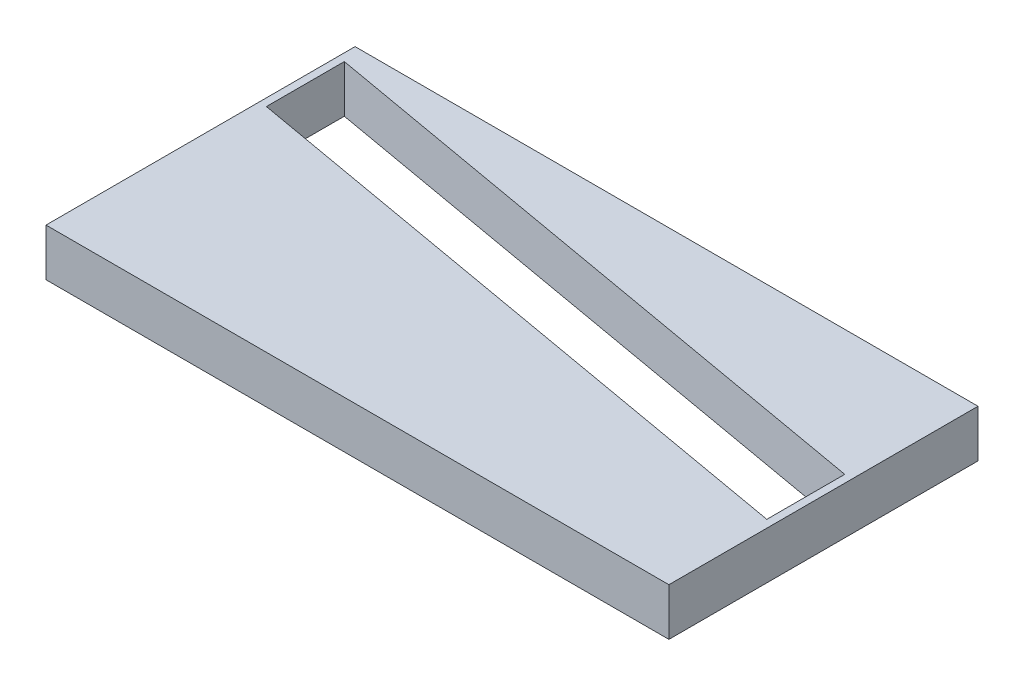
ISO-10303-21;
HEADER;
FILE_DESCRIPTION(('STEP AP214'),'2;1');
FILE_NAME('part.step','',(''),(''),'','','');
FILE_SCHEMA(('AUTOMOTIVE_DESIGN { 1 0 10303 214 1 1 1 1 }'));
ENDSEC;
DATA;
#1=APPLICATION_CONTEXT('core data for automotive mechanical design processes');
#2=APPLICATION_PROTOCOL_DEFINITION('international standard','automotive_design',2000,#1);
#3=PRODUCT_CONTEXT('',#1,'mechanical');
#4=PRODUCT('Part','Part','',(#3));
#5=PRODUCT_RELATED_PRODUCT_CATEGORY('part','',(#4));
#6=PRODUCT_DEFINITION_FORMATION('','',#4);
#7=PRODUCT_DEFINITION_CONTEXT('part definition',#1,'design');
#8=PRODUCT_DEFINITION('design','',#6,#7);
#9=PRODUCT_DEFINITION_SHAPE('','',#8);
#10=(LENGTH_UNIT() NAMED_UNIT(*) SI_UNIT(.MILLI.,.METRE.));
#11=(NAMED_UNIT(*) PLANE_ANGLE_UNIT() SI_UNIT($,.RADIAN.));
#12=(NAMED_UNIT(*) SI_UNIT($,.STERADIAN.) SOLID_ANGLE_UNIT());
#13=UNCERTAINTY_MEASURE_WITH_UNIT(LENGTH_MEASURE(1.E-05),#10,'distance_accuracy_value','');
#14=(GEOMETRIC_REPRESENTATION_CONTEXT(3) GLOBAL_UNCERTAINTY_ASSIGNED_CONTEXT((#13)) GLOBAL_UNIT_ASSIGNED_CONTEXT((#10,
#11,#12)) REPRESENTATION_CONTEXT('',''));
#15=CARTESIAN_POINT('',(0.,0.,0.));
#16=DIRECTION('',(0.,0.,1.));
#17=DIRECTION('',(1.,0.,0.));
#18=AXIS2_PLACEMENT_3D('',#15,#16,#17);
#19=CARTESIAN_POINT('',(668.02,50.8,-331.47));
#20=DIRECTION('',(-1.,0.,0.));
#21=DIRECTION('',(0.,0.,1.));
#22=AXIS2_PLACEMENT_3D('',#19,#20,#21);
#23=PLANE('',#22);
#24=DIRECTION('',(0.,0.,-1.));
#25=VECTOR('',#24,1.);
#26=CARTESIAN_POINT('',(668.02,-50.8,-331.47));
#27=LINE('',#26,#25);
#28=CARTESIAN_POINT('',(668.02,-50.8,331.47));
#29=VERTEX_POINT('',#28);
#30=CARTESIAN_POINT('',(668.02,-50.8,-331.47));
#31=VERTEX_POINT('',#30);
#32=EDGE_CURVE('E129',#29,#31,#27,.T.);
#33=ORIENTED_EDGE('',*,*,#32,.T.);
#34=DIRECTION('',(0.,-1.,0.));
#35=VECTOR('',#34,1.);
#36=CARTESIAN_POINT('',(668.02,50.8,-331.47));
#37=LINE('',#36,#35);
#38=CARTESIAN_POINT('',(668.02,50.8,-331.47));
#39=VERTEX_POINT('',#38);
#40=EDGE_CURVE('E11',#39,#31,#37,.T.);
#41=ORIENTED_EDGE('',*,*,#40,.F.);
#42=DIRECTION('',(0.,0.,-1.));
#43=VECTOR('',#42,1.);
#44=CARTESIAN_POINT('',(668.02,50.8,-331.47));
#45=LINE('',#44,#43);
#46=CARTESIAN_POINT('',(668.02,50.8,331.47));
#47=VERTEX_POINT('',#46);
#48=EDGE_CURVE('E133',#47,#39,#45,.T.);
#49=ORIENTED_EDGE('',*,*,#48,.F.);
#50=DIRECTION('',(0.,-1.,0.));
#51=VECTOR('',#50,1.);
#52=CARTESIAN_POINT('',(668.02,50.8,331.47));
#53=LINE('',#52,#51);
#54=EDGE_CURVE('E143',#47,#29,#53,.T.);
#55=ORIENTED_EDGE('',*,*,#54,.T.);
#56=EDGE_LOOP('',(#33,#41,#49,#55));
#57=FACE_BOUND('',#56,.T.);
#58=ADVANCED_FACE('F32',(#57),#23,.F.);
#59=CARTESIAN_POINT('',(-668.02,50.8,-331.47));
#60=DIRECTION('',(0.,0.,1.));
#61=DIRECTION('',(1.,0.,0.));
#62=AXIS2_PLACEMENT_3D('',#59,#60,#61);
#63=PLANE('',#62);
#64=DIRECTION('',(-1.,0.,0.));
#65=VECTOR('',#64,1.);
#66=CARTESIAN_POINT('',(-668.02,-50.8,-331.47));
#67=LINE('',#66,#65);
#68=CARTESIAN_POINT('',(-668.02,-50.8,-331.47));
#69=VERTEX_POINT('',#68);
#70=EDGE_CURVE('E146',#31,#69,#67,.T.);
#71=ORIENTED_EDGE('',*,*,#70,.T.);
#72=DIRECTION('',(0.,-1.,0.));
#73=VECTOR('',#72,1.);
#74=CARTESIAN_POINT('',(-668.02,50.8,-331.47));
#75=LINE('',#74,#73);
#76=CARTESIAN_POINT('',(-668.02,50.8,-331.47));
#77=VERTEX_POINT('',#76);
#78=EDGE_CURVE('E39',#77,#69,#75,.T.);
#79=ORIENTED_EDGE('',*,*,#78,.F.);
#80=DIRECTION('',(-1.,0.,0.));
#81=VECTOR('',#80,1.);
#82=CARTESIAN_POINT('',(-668.02,50.8,-331.47));
#83=LINE('',#82,#81);
#84=EDGE_CURVE('E136',#39,#77,#83,.T.);
#85=ORIENTED_EDGE('',*,*,#84,.F.);
#86=ORIENTED_EDGE('',*,*,#40,.T.);
#87=EDGE_LOOP('',(#71,#79,#85,#86));
#88=FACE_BOUND('',#87,.T.);
#89=ADVANCED_FACE('F174',(#88),#63,.F.);
#90=CARTESIAN_POINT('',(-668.02,50.8,-331.47));
#91=DIRECTION('',(1.,0.,0.));
#92=DIRECTION('',(0.,0.,-1.));
#93=AXIS2_PLACEMENT_3D('',#90,#91,#92);
#94=PLANE('',#93);
#95=DIRECTION('',(0.,0.,1.));
#96=VECTOR('',#95,1.);
#97=CARTESIAN_POINT('',(-668.02,-50.8,-331.47));
#98=LINE('',#97,#96);
#99=CARTESIAN_POINT('',(-668.02,-50.8,331.47));
#100=VERTEX_POINT('',#99);
#101=EDGE_CURVE('E148',#69,#100,#98,.T.);
#102=ORIENTED_EDGE('',*,*,#101,.T.);
#103=DIRECTION('',(0.,-1.,0.));
#104=VECTOR('',#103,1.);
#105=CARTESIAN_POINT('',(-668.02,50.8,331.47));
#106=LINE('',#105,#104);
#107=CARTESIAN_POINT('',(-668.02,50.8,331.47));
#108=VERTEX_POINT('',#107);
#109=EDGE_CURVE('E153',#108,#100,#106,.T.);
#110=ORIENTED_EDGE('',*,*,#109,.F.);
#111=DIRECTION('',(0.,0.,1.));
#112=VECTOR('',#111,1.);
#113=CARTESIAN_POINT('',(-668.02,50.8,-331.47));
#114=LINE('',#113,#112);
#115=EDGE_CURVE('E139',#77,#108,#114,.T.);
#116=ORIENTED_EDGE('',*,*,#115,.F.);
#117=ORIENTED_EDGE('',*,*,#78,.T.);
#118=EDGE_LOOP('',(#102,#110,#116,#117));
#119=FACE_BOUND('',#118,.T.);
#120=ADVANCED_FACE('F160',(#119),#94,.F.);
#121=CARTESIAN_POINT('',(-668.02,50.8,331.47));
#122=DIRECTION('',(0.,0.,-1.));
#123=DIRECTION('',(-1.,0.,0.));
#124=AXIS2_PLACEMENT_3D('',#121,#122,#123);
#125=PLANE('',#124);
#126=DIRECTION('',(1.,0.,0.));
#127=VECTOR('',#126,1.);
#128=CARTESIAN_POINT('',(-668.02,-50.8,331.47));
#129=LINE('',#128,#127);
#130=EDGE_CURVE('E137',#100,#29,#129,.T.);
#131=ORIENTED_EDGE('',*,*,#130,.T.);
#132=ORIENTED_EDGE('',*,*,#54,.F.);
#133=DIRECTION('',(1.,0.,0.));
#134=VECTOR('',#133,1.);
#135=CARTESIAN_POINT('',(-668.02,50.8,331.47));
#136=LINE('',#135,#134);
#137=EDGE_CURVE('E141',#108,#47,#136,.T.);
#138=ORIENTED_EDGE('',*,*,#137,.F.);
#139=ORIENTED_EDGE('',*,*,#109,.T.);
#140=EDGE_LOOP('',(#131,#132,#138,#139));
#141=FACE_BOUND('',#140,.T.);
#142=ADVANCED_FACE('F167',(#141),#125,.F.);
#143=CARTESIAN_POINT('',(668.02,50.8,331.47));
#144=DIRECTION('',(0.,1.,0.));
#145=DIRECTION('',(0.,0.,1.));
#146=AXIS2_PLACEMENT_3D('',#143,#144,#145);
#147=PLANE('',#146);
#148=DIRECTION('',(-0.000177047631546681,0.,0.999999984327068));
#149=VECTOR('',#148,1.);
#150=CARTESIAN_POINT('',(-651.799669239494,50.8,-124.993040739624));
#151=LINE('',#150,#149);
#152=CARTESIAN_POINT('',(-651.770079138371,50.8,-292.123774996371));
#153=VERTEX_POINT('',#152);
#154=CARTESIAN_POINT('',(-651.799669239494,50.8,-124.993040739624));
#155=VERTEX_POINT('',#154);
#156=EDGE_CURVE('E46',#153,#155,#151,.T.);
#157=ORIENTED_EDGE('',*,*,#156,.F.);
#158=DIRECTION('',(-0.984779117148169,0.,-0.173810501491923));
#159=VECTOR('',#158,1.);
#160=CARTESIAN_POINT('',(-651.770079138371,50.8,-292.123774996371));
#161=LINE('',#160,#159);
#162=CARTESIAN_POINT('',(651.58895238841,50.8,-62.0848932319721));
#163=VERTEX_POINT('',#162);
#164=EDGE_CURVE('E114',#163,#153,#161,.T.);
#165=ORIENTED_EDGE('',*,*,#164,.F.);
#166=DIRECTION('',(0.000177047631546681,0.,-0.999999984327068));
#167=VECTOR('',#166,1.);
#168=CARTESIAN_POINT('',(651.559362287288,50.8,105.045841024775));
#169=LINE('',#168,#167);
#170=CARTESIAN_POINT('',(651.559362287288,50.8,105.045841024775));
#171=VERTEX_POINT('',#170);
#172=EDGE_CURVE('E117',#171,#163,#169,.T.);
#173=ORIENTED_EDGE('',*,*,#172,.F.);
#174=DIRECTION('',(0.984779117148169,0.,0.173810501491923));
#175=VECTOR('',#174,1.);
#176=CARTESIAN_POINT('',(-651.799669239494,50.8,-124.993040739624));
#177=LINE('',#176,#175);
#178=EDGE_CURVE('E123',#155,#171,#177,.T.);
#179=ORIENTED_EDGE('',*,*,#178,.F.);
#180=EDGE_LOOP('',(#157,#165,#173,#179));
#181=FACE_BOUND('',#180,.T.);
#182=ORIENTED_EDGE('',*,*,#48,.T.);
#183=ORIENTED_EDGE('',*,*,#84,.T.);
#184=ORIENTED_EDGE('',*,*,#115,.T.);
#185=ORIENTED_EDGE('',*,*,#137,.T.);
#186=EDGE_LOOP('',(#182,#183,#184,#185));
#187=FACE_BOUND('',#186,.T.);
#188=ADVANCED_FACE('F173',(#181,#187),#147,.T.);
#189=CARTESIAN_POINT('',(668.02,-50.8,331.47));
#190=DIRECTION('',(0.,1.,0.));
#191=DIRECTION('',(0.,0.,1.));
#192=AXIS2_PLACEMENT_3D('',#189,#190,#191);
#193=PLANE('',#192);
#194=DIRECTION('',(-0.984779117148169,0.,-0.173810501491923));
#195=VECTOR('',#194,1.);
#196=CARTESIAN_POINT('',(-651.770079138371,-50.8,-292.123774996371));
#197=LINE('',#196,#195);
#198=CARTESIAN_POINT('',(651.58895238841,-50.8,-62.0848932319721));
#199=VERTEX_POINT('',#198);
#200=CARTESIAN_POINT('',(-651.770079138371,-50.8,-292.123774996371));
#201=VERTEX_POINT('',#200);
#202=EDGE_CURVE('E104',#199,#201,#197,.T.);
#203=ORIENTED_EDGE('',*,*,#202,.T.);
#204=DIRECTION('',(-0.000177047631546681,0.,0.999999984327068));
#205=VECTOR('',#204,1.);
#206=CARTESIAN_POINT('',(-651.799669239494,-50.8,-124.993040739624));
#207=LINE('',#206,#205);
#208=CARTESIAN_POINT('',(-651.799669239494,-50.8,-124.993040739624));
#209=VERTEX_POINT('',#208);
#210=EDGE_CURVE('E98',#201,#209,#207,.T.);
#211=ORIENTED_EDGE('',*,*,#210,.T.);
#212=DIRECTION('',(0.984779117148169,0.,0.173810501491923));
#213=VECTOR('',#212,1.);
#214=CARTESIAN_POINT('',(-651.799669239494,-50.8,-124.993040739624));
#215=LINE('',#214,#213);
#216=CARTESIAN_POINT('',(651.559362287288,-50.8,105.045841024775));
#217=VERTEX_POINT('',#216);
#218=EDGE_CURVE('E107',#209,#217,#215,.T.);
#219=ORIENTED_EDGE('',*,*,#218,.T.);
#220=DIRECTION('',(0.000177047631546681,0.,-0.999999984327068));
#221=VECTOR('',#220,1.);
#222=CARTESIAN_POINT('',(651.559362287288,-50.8,105.045841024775));
#223=LINE('',#222,#221);
#224=EDGE_CURVE('E54',#217,#199,#223,.T.);
#225=ORIENTED_EDGE('',*,*,#224,.T.);
#226=EDGE_LOOP('',(#203,#211,#219,#225));
#227=FACE_BOUND('',#226,.T.);
#228=ORIENTED_EDGE('',*,*,#32,.F.);
#229=ORIENTED_EDGE('',*,*,#130,.F.);
#230=ORIENTED_EDGE('',*,*,#101,.F.);
#231=ORIENTED_EDGE('',*,*,#70,.F.);
#232=EDGE_LOOP('',(#228,#229,#230,#231));
#233=FACE_BOUND('',#232,.T.);
#234=ADVANCED_FACE('F111',(#227,#233),#193,.F.);
#235=CARTESIAN_POINT('',(-651.799669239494,-50.8,-124.993040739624));
#236=DIRECTION('',(-0.999999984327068,0.,-0.000177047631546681));
#237=DIRECTION('',(-0.000177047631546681,0.,0.999999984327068));
#238=AXIS2_PLACEMENT_3D('',#235,#236,#237);
#239=PLANE('',#238);
#240=ORIENTED_EDGE('',*,*,#156,.T.);
#241=DIRECTION('',(0.,1.,0.));
#242=VECTOR('',#241,1.);
#243=CARTESIAN_POINT('',(-651.799669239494,-50.8,-124.993040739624));
#244=LINE('',#243,#242);
#245=EDGE_CURVE('E94',#209,#155,#244,.T.);
#246=ORIENTED_EDGE('',*,*,#245,.F.);
#247=ORIENTED_EDGE('',*,*,#210,.F.);
#248=DIRECTION('',(0.,1.,0.));
#249=VECTOR('',#248,1.);
#250=CARTESIAN_POINT('',(-651.770079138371,-50.8,-292.123774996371));
#251=LINE('',#250,#249);
#252=EDGE_CURVE('E127',#201,#153,#251,.T.);
#253=ORIENTED_EDGE('',*,*,#252,.T.);
#254=EDGE_LOOP('',(#240,#246,#247,#253));
#255=FACE_BOUND('',#254,.T.);
#256=ADVANCED_FACE('F96',(#255),#239,.F.);
#257=CARTESIAN_POINT('',(-651.770079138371,-50.8,-292.123774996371));
#258=DIRECTION('',(0.173810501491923,0.,-0.984779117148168));
#259=DIRECTION('',(-0.984779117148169,0.,-0.173810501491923));
#260=AXIS2_PLACEMENT_3D('',#257,#258,#259);
#261=PLANE('',#260);
#262=ORIENTED_EDGE('',*,*,#164,.T.);
#263=ORIENTED_EDGE('',*,*,#252,.F.);
#264=ORIENTED_EDGE('',*,*,#202,.F.);
#265=DIRECTION('',(0.,1.,0.));
#266=VECTOR('',#265,1.);
#267=CARTESIAN_POINT('',(651.58895238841,-50.8,-62.0848932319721));
#268=LINE('',#267,#266);
#269=EDGE_CURVE('E130',#199,#163,#268,.T.);
#270=ORIENTED_EDGE('',*,*,#269,.T.);
#271=EDGE_LOOP('',(#262,#263,#264,#270));
#272=FACE_BOUND('',#271,.T.);
#273=ADVANCED_FACE('F191',(#272),#261,.F.);
#274=CARTESIAN_POINT('',(651.559362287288,-50.8,105.045841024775));
#275=DIRECTION('',(0.999999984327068,0.,0.000177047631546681));
#276=DIRECTION('',(0.000177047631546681,0.,-0.999999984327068));
#277=AXIS2_PLACEMENT_3D('',#274,#275,#276);
#278=PLANE('',#277);
#279=ORIENTED_EDGE('',*,*,#172,.T.);
#280=ORIENTED_EDGE('',*,*,#269,.F.);
#281=ORIENTED_EDGE('',*,*,#224,.F.);
#282=DIRECTION('',(0.,1.,0.));
#283=VECTOR('',#282,1.);
#284=CARTESIAN_POINT('',(651.559362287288,-50.8,105.045841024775));
#285=LINE('',#284,#283);
#286=EDGE_CURVE('E103',#217,#171,#285,.T.);
#287=ORIENTED_EDGE('',*,*,#286,.T.);
#288=EDGE_LOOP('',(#279,#280,#281,#287));
#289=FACE_BOUND('',#288,.T.);
#290=ADVANCED_FACE('F194',(#289),#278,.F.);
#291=CARTESIAN_POINT('',(-651.799669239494,-50.8,-124.993040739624));
#292=DIRECTION('',(-0.173810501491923,0.,0.984779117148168));
#293=DIRECTION('',(0.984779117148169,0.,0.173810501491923));
#294=AXIS2_PLACEMENT_3D('',#291,#292,#293);
#295=PLANE('',#294);
#296=ORIENTED_EDGE('',*,*,#178,.T.);
#297=ORIENTED_EDGE('',*,*,#286,.F.);
#298=ORIENTED_EDGE('',*,*,#218,.F.);
#299=ORIENTED_EDGE('',*,*,#245,.T.);
#300=EDGE_LOOP('',(#296,#297,#298,#299));
#301=FACE_BOUND('',#300,.T.);
#302=ADVANCED_FACE('F108',(#301),#295,.F.);
#303=CLOSED_SHELL('',(#58,#89,#120,#142,#188,#234,#256,#273,#290,#302));
#304=MANIFOLD_SOLID_BREP('B2',#303);
#305=ADVANCED_BREP_SHAPE_REPRESENTATION('',(#18,#304),#14);
#306=SHAPE_DEFINITION_REPRESENTATION(#9,#305);
ENDSEC;
END-ISO-10303-21;
